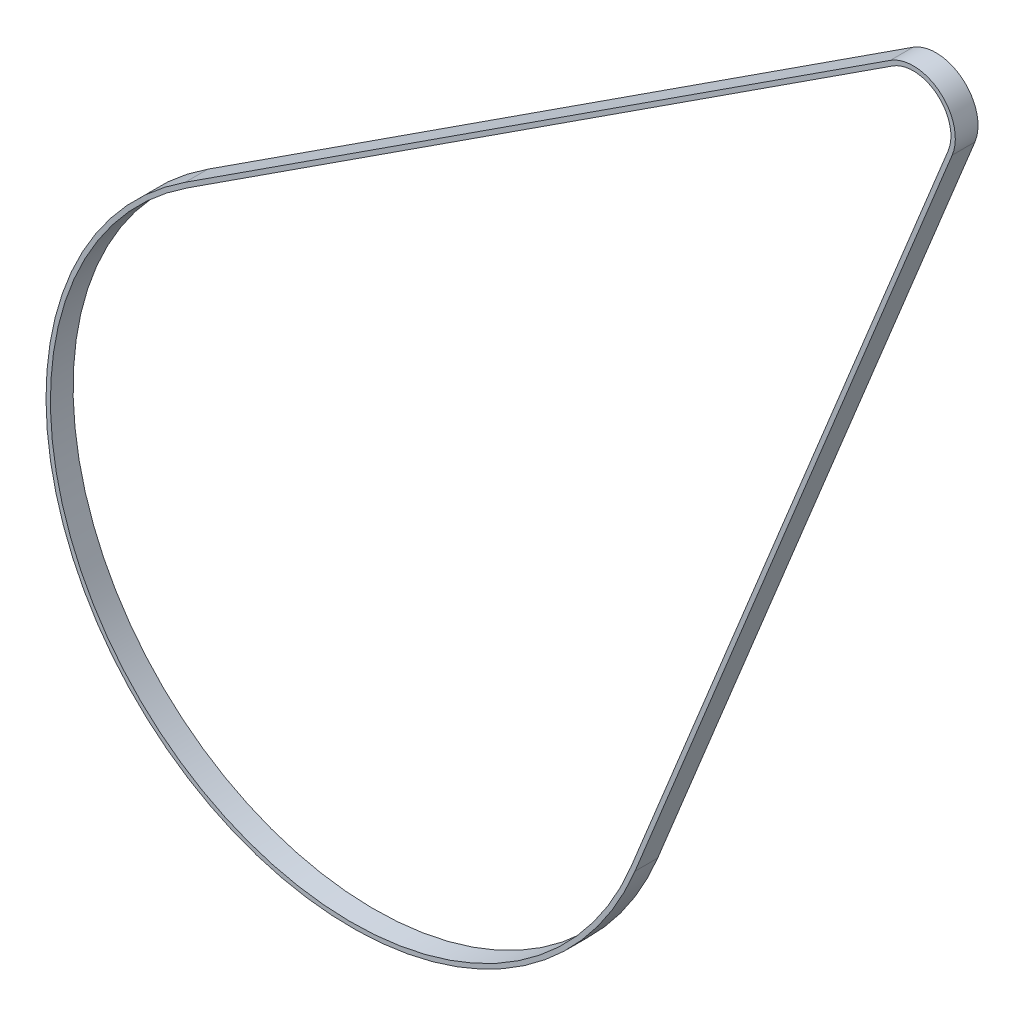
ISO-10303-21;
HEADER;
FILE_DESCRIPTION(('STEP AP214'),'2;1');
FILE_NAME('part.step','',(''),(''),'','','');
FILE_SCHEMA(('AUTOMOTIVE_DESIGN { 1 0 10303 214 1 1 1 1 }'));
ENDSEC;
DATA;
#1=APPLICATION_CONTEXT('core data for automotive mechanical design processes');
#2=APPLICATION_PROTOCOL_DEFINITION('international standard','automotive_design',2000,#1);
#3=PRODUCT_CONTEXT('',#1,'mechanical');
#4=PRODUCT('Part','Part','',(#3));
#5=PRODUCT_RELATED_PRODUCT_CATEGORY('part','',(#4));
#6=PRODUCT_DEFINITION_FORMATION('','',#4);
#7=PRODUCT_DEFINITION_CONTEXT('part definition',#1,'design');
#8=PRODUCT_DEFINITION('design','',#6,#7);
#9=PRODUCT_DEFINITION_SHAPE('','',#8);
#10=(LENGTH_UNIT() NAMED_UNIT(*) SI_UNIT(.MILLI.,.METRE.));
#11=(NAMED_UNIT(*) PLANE_ANGLE_UNIT() SI_UNIT($,.RADIAN.));
#12=(NAMED_UNIT(*) SI_UNIT($,.STERADIAN.) SOLID_ANGLE_UNIT());
#13=UNCERTAINTY_MEASURE_WITH_UNIT(LENGTH_MEASURE(1.E-05),#10,'distance_accuracy_value','');
#14=(GEOMETRIC_REPRESENTATION_CONTEXT(3) GLOBAL_UNCERTAINTY_ASSIGNED_CONTEXT((#13)) GLOBAL_UNIT_ASSIGNED_CONTEXT((#10,
#11,#12)) REPRESENTATION_CONTEXT('',''));
#15=CARTESIAN_POINT('',(0.,0.,0.));
#16=DIRECTION('',(0.,0.,1.));
#17=DIRECTION('',(1.,0.,0.));
#18=AXIS2_PLACEMENT_3D('',#15,#16,#17);
#19=CARTESIAN_POINT('',(39.0575616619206,-20.,31.715));
#20=DIRECTION('',(0.,0.,1.));
#21=DIRECTION('',(1.,0.,0.));
#22=AXIS2_PLACEMENT_3D('',#19,#20,#21);
#23=PLANE('',#22);
#24=CARTESIAN_POINT('',(39.0575616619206,-20.,31.715));
#25=DIRECTION('',(0.,0.,1.));
#26=DIRECTION('',(1.,0.,0.));
#27=AXIS2_PLACEMENT_3D('',#24,#25,#26);
#28=CIRCLE('',#27,4.80000000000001);
#29=CARTESIAN_POINT('',(43.5028664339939,-21.8108742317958,31.715));
#30=VERTEX_POINT('',#29);
#31=CARTESIAN_POINT('',(36.442339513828,-15.9750014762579,31.715));
#32=VERTEX_POINT('',#31);
#33=EDGE_CURVE('E159',#30,#32,#28,.T.);
#34=ORIENTED_EDGE('',*,*,#33,.T.);
#35=DIRECTION('',(-0.838541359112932,-0.544837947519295,0.));
#36=VECTOR('',#35,1.);
#37=CARTESIAN_POINT('',(-44.0071975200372,-68.2466755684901,31.715));
#38=LINE('',#37,#36);
#39=CARTESIAN_POINT('',(-44.0071975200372,-68.2466755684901,31.715));
#40=VERTEX_POINT('',#39);
#41=EDGE_CURVE('E162',#32,#40,#38,.T.);
#42=ORIENTED_EDGE('',*,*,#41,.T.);
#43=CARTESIAN_POINT('',(-25.,-97.5,31.715));
#44=DIRECTION('',(0.,0.,1.));
#45=DIRECTION('',(1.,0.,0.));
#46=AXIS2_PLACEMENT_3D('',#43,#44,#45);
#47=CIRCLE('',#46,34.8859649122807);
#48=CARTESIAN_POINT('',(7.3080721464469,-110.661269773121,31.715));
#49=VERTEX_POINT('',#48);
#50=EDGE_CURVE('E165',#40,#49,#47,.T.);
#51=ORIENTED_EDGE('',*,*,#50,.T.);
#52=DIRECTION('',(0.377265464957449,0.926105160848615,0.));
#53=VECTOR('',#52,1.);
#54=CARTESIAN_POINT('',(7.3080721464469,-110.661269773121,31.715));
#55=LINE('',#54,#53);
#56=EDGE_CURVE('E167',#49,#30,#55,.T.);
#57=ORIENTED_EDGE('',*,*,#56,.T.);
#58=EDGE_LOOP('',(#34,#42,#51,#57));
#59=FACE_BOUND('',#58,.T.);
#60=DIRECTION('',(-0.838541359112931,-0.544837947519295,0.));
#61=VECTOR('',#60,1.);
#62=CARTESIAN_POINT('',(-43.7347785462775,-68.6659462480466,31.715));
#63=LINE('',#62,#61);
#64=CARTESIAN_POINT('',(36.7147584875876,-16.3942721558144,31.715));
#65=VERTEX_POINT('',#64);
#66=CARTESIAN_POINT('',(-43.7347785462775,-68.6659462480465,31.715));
#67=VERTEX_POINT('',#66);
#68=EDGE_CURVE('E131',#65,#67,#63,.T.);
#69=ORIENTED_EDGE('',*,*,#68,.F.);
#70=CARTESIAN_POINT('',(39.0575616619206,-20.,31.715));
#71=DIRECTION('',(0.,0.,1.));
#72=DIRECTION('',(1.,0.,0.));
#73=AXIS2_PLACEMENT_3D('',#70,#71,#72);
#74=CIRCLE('',#73,4.30000000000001);
#75=CARTESIAN_POINT('',(43.0398138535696,-21.622241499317,31.715));
#76=VERTEX_POINT('',#75);
#77=EDGE_CURVE('E123',#76,#65,#74,.T.);
#78=ORIENTED_EDGE('',*,*,#77,.F.);
#79=DIRECTION('',(0.377265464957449,0.926105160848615,0.));
#80=VECTOR('',#79,1.);
#81=CARTESIAN_POINT('',(6.84501956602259,-110.472637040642,31.715));
#82=LINE('',#81,#80);
#83=CARTESIAN_POINT('',(6.84501956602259,-110.472637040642,31.715));
#84=VERTEX_POINT('',#83);
#85=EDGE_CURVE('E145',#84,#76,#82,.T.);
#86=ORIENTED_EDGE('',*,*,#85,.F.);
#87=CARTESIAN_POINT('',(-25.,-97.5,31.715));
#88=DIRECTION('',(0.,0.,1.));
#89=DIRECTION('',(1.,0.,0.));
#90=AXIS2_PLACEMENT_3D('',#87,#88,#89);
#91=CIRCLE('',#90,34.3859649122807);
#92=EDGE_CURVE('E143',#67,#84,#91,.T.);
#93=ORIENTED_EDGE('',*,*,#92,.F.);
#94=EDGE_LOOP('',(#69,#78,#86,#93));
#95=FACE_BOUND('',#94,.T.);
#96=ADVANCED_FACE('F58',(#59,#95),#23,.T.);
#97=CARTESIAN_POINT('',(39.0575616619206,-20.,29.125));
#98=DIRECTION('',(0.,0.,1.));
#99=DIRECTION('',(1.,0.,0.));
#100=AXIS2_PLACEMENT_3D('',#97,#98,#99);
#101=PLANE('',#100);
#102=CARTESIAN_POINT('',(39.0575616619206,-20.,29.125));
#103=DIRECTION('',(0.,0.,1.));
#104=DIRECTION('',(1.,0.,0.));
#105=AXIS2_PLACEMENT_3D('',#102,#103,#104);
#106=CIRCLE('',#105,4.80000000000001);
#107=CARTESIAN_POINT('',(43.5028664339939,-21.8108742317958,29.125));
#108=VERTEX_POINT('',#107);
#109=CARTESIAN_POINT('',(36.442339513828,-15.9750014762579,29.125));
#110=VERTEX_POINT('',#109);
#111=EDGE_CURVE('E139',#108,#110,#106,.T.);
#112=ORIENTED_EDGE('',*,*,#111,.F.);
#113=DIRECTION('',(0.377265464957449,0.926105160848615,0.));
#114=VECTOR('',#113,1.);
#115=CARTESIAN_POINT('',(7.3080721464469,-110.661269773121,29.125));
#116=LINE('',#115,#114);
#117=CARTESIAN_POINT('',(7.3080721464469,-110.661269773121,29.125));
#118=VERTEX_POINT('',#117);
#119=EDGE_CURVE('E163',#118,#108,#116,.T.);
#120=ORIENTED_EDGE('',*,*,#119,.F.);
#121=CARTESIAN_POINT('',(-25.,-97.5,29.125));
#122=DIRECTION('',(0.,0.,1.));
#123=DIRECTION('',(1.,0.,0.));
#124=AXIS2_PLACEMENT_3D('',#121,#122,#123);
#125=CIRCLE('',#124,34.8859649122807);
#126=CARTESIAN_POINT('',(-44.0071975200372,-68.2466755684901,29.125));
#127=VERTEX_POINT('',#126);
#128=EDGE_CURVE('E174',#127,#118,#125,.T.);
#129=ORIENTED_EDGE('',*,*,#128,.F.);
#130=DIRECTION('',(-0.838541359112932,-0.544837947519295,0.));
#131=VECTOR('',#130,1.);
#132=CARTESIAN_POINT('',(-44.0071975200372,-68.2466755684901,29.125));
#133=LINE('',#132,#131);
#134=EDGE_CURVE('E172',#110,#127,#133,.T.);
#135=ORIENTED_EDGE('',*,*,#134,.F.);
#136=EDGE_LOOP('',(#112,#120,#129,#135));
#137=FACE_BOUND('',#136,.T.);
#138=CARTESIAN_POINT('',(39.0575616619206,-20.,29.125));
#139=DIRECTION('',(0.,0.,1.));
#140=DIRECTION('',(1.,0.,0.));
#141=AXIS2_PLACEMENT_3D('',#138,#139,#140);
#142=CIRCLE('',#141,4.30000000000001);
#143=CARTESIAN_POINT('',(43.0398138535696,-21.622241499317,29.125));
#144=VERTEX_POINT('',#143);
#145=CARTESIAN_POINT('',(36.7147584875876,-16.3942721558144,29.125));
#146=VERTEX_POINT('',#145);
#147=EDGE_CURVE('E81',#144,#146,#142,.T.);
#148=ORIENTED_EDGE('',*,*,#147,.T.);
#149=DIRECTION('',(-0.838541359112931,-0.544837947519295,0.));
#150=VECTOR('',#149,1.);
#151=CARTESIAN_POINT('',(-43.7347785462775,-68.6659462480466,29.125));
#152=LINE('',#151,#150);
#153=CARTESIAN_POINT('',(-43.7347785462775,-68.6659462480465,29.125));
#154=VERTEX_POINT('',#153);
#155=EDGE_CURVE('E138',#146,#154,#152,.T.);
#156=ORIENTED_EDGE('',*,*,#155,.T.);
#157=CARTESIAN_POINT('',(-25.,-97.5,29.125));
#158=DIRECTION('',(0.,0.,1.));
#159=DIRECTION('',(1.,0.,0.));
#160=AXIS2_PLACEMENT_3D('',#157,#158,#159);
#161=CIRCLE('',#160,34.3859649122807);
#162=CARTESIAN_POINT('',(6.84501956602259,-110.472637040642,29.125));
#163=VERTEX_POINT('',#162);
#164=EDGE_CURVE('E151',#154,#163,#161,.T.);
#165=ORIENTED_EDGE('',*,*,#164,.T.);
#166=DIRECTION('',(0.377265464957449,0.926105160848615,0.));
#167=VECTOR('',#166,1.);
#168=CARTESIAN_POINT('',(6.84501956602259,-110.472637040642,29.125));
#169=LINE('',#168,#167);
#170=EDGE_CURVE('E132',#163,#144,#169,.T.);
#171=ORIENTED_EDGE('',*,*,#170,.T.);
#172=EDGE_LOOP('',(#148,#156,#165,#171));
#173=FACE_BOUND('',#172,.T.);
#174=ADVANCED_FACE('F192',(#137,#173),#101,.F.);
#175=CARTESIAN_POINT('',(39.0575616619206,-20.,31.715));
#176=DIRECTION('',(0.,0.,-1.));
#177=DIRECTION('',(-1.,0.,0.));
#178=AXIS2_PLACEMENT_3D('',#175,#176,#177);
#179=CYLINDRICAL_SURFACE('',#178,4.80000000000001);
#180=ORIENTED_EDGE('',*,*,#111,.T.);
#181=DIRECTION('',(0.,0.,-1.));
#182=VECTOR('',#181,1.);
#183=CARTESIAN_POINT('',(36.442339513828,-15.9750014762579,31.715));
#184=LINE('',#183,#182);
#185=EDGE_CURVE('E12',#32,#110,#184,.T.);
#186=ORIENTED_EDGE('',*,*,#185,.F.);
#187=ORIENTED_EDGE('',*,*,#33,.F.);
#188=DIRECTION('',(0.,0.,-1.));
#189=VECTOR('',#188,1.);
#190=CARTESIAN_POINT('',(43.5028664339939,-21.8108742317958,31.715));
#191=LINE('',#190,#189);
#192=EDGE_CURVE('E169',#30,#108,#191,.T.);
#193=ORIENTED_EDGE('',*,*,#192,.T.);
#194=EDGE_LOOP('',(#180,#186,#187,#193));
#195=FACE_BOUND('',#194,.T.);
#196=ADVANCED_FACE('F60',(#195),#179,.T.);
#197=CARTESIAN_POINT('',(-44.0071975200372,-68.2466755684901,31.715));
#198=DIRECTION('',(0.544837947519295,-0.838541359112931,0.));
#199=DIRECTION('',(0.838541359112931,0.544837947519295,0.));
#200=AXIS2_PLACEMENT_3D('',#197,#198,#199);
#201=PLANE('',#200);
#202=ORIENTED_EDGE('',*,*,#134,.T.);
#203=DIRECTION('',(0.,0.,-1.));
#204=VECTOR('',#203,1.);
#205=CARTESIAN_POINT('',(-44.0071975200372,-68.2466755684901,31.715));
#206=LINE('',#205,#204);
#207=EDGE_CURVE('E66',#40,#127,#206,.T.);
#208=ORIENTED_EDGE('',*,*,#207,.F.);
#209=ORIENTED_EDGE('',*,*,#41,.F.);
#210=ORIENTED_EDGE('',*,*,#185,.T.);
#211=EDGE_LOOP('',(#202,#208,#209,#210));
#212=FACE_BOUND('',#211,.T.);
#213=ADVANCED_FACE('F202',(#212),#201,.F.);
#214=CARTESIAN_POINT('',(-25.,-97.5,31.715));
#215=DIRECTION('',(0.,0.,-1.));
#216=DIRECTION('',(-1.,0.,0.));
#217=AXIS2_PLACEMENT_3D('',#214,#215,#216);
#218=CYLINDRICAL_SURFACE('',#217,34.8859649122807);
#219=ORIENTED_EDGE('',*,*,#128,.T.);
#220=DIRECTION('',(0.,0.,-1.));
#221=VECTOR('',#220,1.);
#222=CARTESIAN_POINT('',(7.3080721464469,-110.661269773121,31.715));
#223=LINE('',#222,#221);
#224=EDGE_CURVE('E179',#49,#118,#223,.T.);
#225=ORIENTED_EDGE('',*,*,#224,.F.);
#226=ORIENTED_EDGE('',*,*,#50,.F.);
#227=ORIENTED_EDGE('',*,*,#207,.T.);
#228=EDGE_LOOP('',(#219,#225,#226,#227));
#229=FACE_BOUND('',#228,.T.);
#230=ADVANCED_FACE('F186',(#229),#218,.T.);
#231=CARTESIAN_POINT('',(7.3080721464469,-110.661269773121,31.715));
#232=DIRECTION('',(-0.926105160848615,0.377265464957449,0.));
#233=DIRECTION('',(-0.377265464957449,-0.926105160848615,0.));
#234=AXIS2_PLACEMENT_3D('',#231,#232,#233);
#235=PLANE('',#234);
#236=ORIENTED_EDGE('',*,*,#119,.T.);
#237=ORIENTED_EDGE('',*,*,#192,.F.);
#238=ORIENTED_EDGE('',*,*,#56,.F.);
#239=ORIENTED_EDGE('',*,*,#224,.T.);
#240=EDGE_LOOP('',(#236,#237,#238,#239));
#241=FACE_BOUND('',#240,.T.);
#242=ADVANCED_FACE('F196',(#241),#235,.F.);
#243=CARTESIAN_POINT('',(39.0575616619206,-20.,31.715));
#244=DIRECTION('',(0.,0.,-1.));
#245=DIRECTION('',(-1.,0.,0.));
#246=AXIS2_PLACEMENT_3D('',#243,#244,#245);
#247=CYLINDRICAL_SURFACE('',#246,4.30000000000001);
#248=ORIENTED_EDGE('',*,*,#147,.F.);
#249=DIRECTION('',(0.,0.,-1.));
#250=VECTOR('',#249,1.);
#251=CARTESIAN_POINT('',(43.0398138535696,-21.622241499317,31.715));
#252=LINE('',#251,#250);
#253=EDGE_CURVE('E127',#76,#144,#252,.T.);
#254=ORIENTED_EDGE('',*,*,#253,.F.);
#255=ORIENTED_EDGE('',*,*,#77,.T.);
#256=DIRECTION('',(0.,0.,-1.));
#257=VECTOR('',#256,1.);
#258=CARTESIAN_POINT('',(36.7147584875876,-16.3942721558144,31.715));
#259=LINE('',#258,#257);
#260=EDGE_CURVE('E126',#65,#146,#259,.T.);
#261=ORIENTED_EDGE('',*,*,#260,.T.);
#262=EDGE_LOOP('',(#248,#254,#255,#261));
#263=FACE_BOUND('',#262,.T.);
#264=ADVANCED_FACE('F125',(#263),#247,.F.);
#265=CARTESIAN_POINT('',(-43.7347785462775,-68.6659462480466,31.715));
#266=DIRECTION('',(0.544837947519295,-0.838541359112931,0.));
#267=DIRECTION('',(0.838541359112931,0.544837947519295,0.));
#268=AXIS2_PLACEMENT_3D('',#265,#266,#267);
#269=PLANE('',#268);
#270=ORIENTED_EDGE('',*,*,#155,.F.);
#271=ORIENTED_EDGE('',*,*,#260,.F.);
#272=ORIENTED_EDGE('',*,*,#68,.T.);
#273=DIRECTION('',(0.,0.,-1.));
#274=VECTOR('',#273,1.);
#275=CARTESIAN_POINT('',(-43.7347785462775,-68.6659462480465,31.715));
#276=LINE('',#275,#274);
#277=EDGE_CURVE('E140',#67,#154,#276,.T.);
#278=ORIENTED_EDGE('',*,*,#277,.T.);
#279=EDGE_LOOP('',(#270,#271,#272,#278));
#280=FACE_BOUND('',#279,.T.);
#281=ADVANCED_FACE('F135',(#280),#269,.T.);
#282=CARTESIAN_POINT('',(-25.,-97.5,31.715));
#283=DIRECTION('',(0.,0.,-1.));
#284=DIRECTION('',(-1.,0.,0.));
#285=AXIS2_PLACEMENT_3D('',#282,#283,#284);
#286=CYLINDRICAL_SURFACE('',#285,34.3859649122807);
#287=ORIENTED_EDGE('',*,*,#164,.F.);
#288=ORIENTED_EDGE('',*,*,#277,.F.);
#289=ORIENTED_EDGE('',*,*,#92,.T.);
#290=DIRECTION('',(0.,0.,-1.));
#291=VECTOR('',#290,1.);
#292=CARTESIAN_POINT('',(6.84501956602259,-110.472637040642,31.715));
#293=LINE('',#292,#291);
#294=EDGE_CURVE('E73',#84,#163,#293,.T.);
#295=ORIENTED_EDGE('',*,*,#294,.T.);
#296=EDGE_LOOP('',(#287,#288,#289,#295));
#297=FACE_BOUND('',#296,.T.);
#298=ADVANCED_FACE('F225',(#297),#286,.F.);
#299=CARTESIAN_POINT('',(6.84501956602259,-110.472637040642,31.715));
#300=DIRECTION('',(-0.926105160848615,0.377265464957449,0.));
#301=DIRECTION('',(-0.377265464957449,-0.926105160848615,0.));
#302=AXIS2_PLACEMENT_3D('',#299,#300,#301);
#303=PLANE('',#302);
#304=ORIENTED_EDGE('',*,*,#170,.F.);
#305=ORIENTED_EDGE('',*,*,#294,.F.);
#306=ORIENTED_EDGE('',*,*,#85,.T.);
#307=ORIENTED_EDGE('',*,*,#253,.T.);
#308=EDGE_LOOP('',(#304,#305,#306,#307));
#309=FACE_BOUND('',#308,.T.);
#310=ADVANCED_FACE('F229',(#309),#303,.T.);
#311=CLOSED_SHELL('',(#96,#174,#196,#213,#230,#242,#264,#281,#298,#310));
#312=MANIFOLD_SOLID_BREP('B2',#311);
#313=ADVANCED_BREP_SHAPE_REPRESENTATION('',(#18,#312),#14);
#314=SHAPE_DEFINITION_REPRESENTATION(#9,#313);
ENDSEC;
END-ISO-10303-21;
